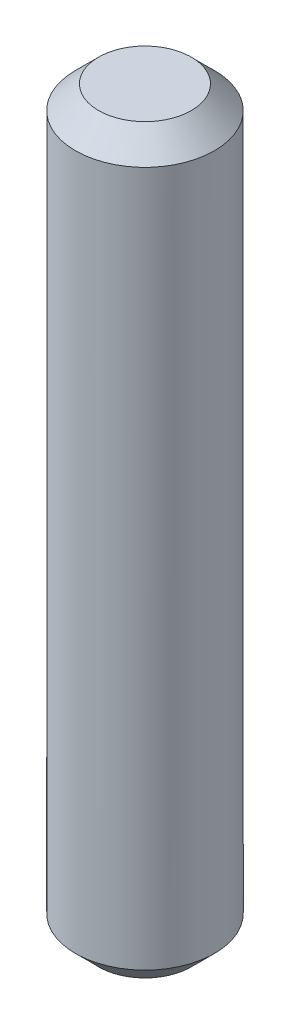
ISO-10303-21;
HEADER;
FILE_DESCRIPTION(('STEP AP214'),'2;1');
FILE_NAME('part.step','',(''),(''),'','','');
FILE_SCHEMA(('AUTOMOTIVE_DESIGN { 1 0 10303 214 1 1 1 1 }'));
ENDSEC;
DATA;
#1=APPLICATION_CONTEXT('core data for automotive mechanical design processes');
#2=APPLICATION_PROTOCOL_DEFINITION('international standard','automotive_design',2000,#1);
#3=PRODUCT_CONTEXT('',#1,'mechanical');
#4=PRODUCT('Part','Part','',(#3));
#5=PRODUCT_RELATED_PRODUCT_CATEGORY('part','',(#4));
#6=PRODUCT_DEFINITION_FORMATION('','',#4);
#7=PRODUCT_DEFINITION_CONTEXT('part definition',#1,'design');
#8=PRODUCT_DEFINITION('design','',#6,#7);
#9=PRODUCT_DEFINITION_SHAPE('','',#8);
#10=(LENGTH_UNIT() NAMED_UNIT(*) SI_UNIT(.MILLI.,.METRE.));
#11=(NAMED_UNIT(*) PLANE_ANGLE_UNIT() SI_UNIT($,.RADIAN.));
#12=(NAMED_UNIT(*) SI_UNIT($,.STERADIAN.) SOLID_ANGLE_UNIT());
#13=UNCERTAINTY_MEASURE_WITH_UNIT(LENGTH_MEASURE(1.E-05),#10,'distance_accuracy_value','');
#14=(GEOMETRIC_REPRESENTATION_CONTEXT(3) GLOBAL_UNCERTAINTY_ASSIGNED_CONTEXT((#13)) GLOBAL_UNIT_ASSIGNED_CONTEXT((#10,
#11,#12)) REPRESENTATION_CONTEXT('',''));
#15=CARTESIAN_POINT('',(0.,0.,0.));
#16=DIRECTION('',(0.,0.,1.));
#17=DIRECTION('',(1.,0.,0.));
#18=AXIS2_PLACEMENT_3D('',#15,#16,#17);
#19=CARTESIAN_POINT('',(0.,-4.,0.));
#20=DIRECTION('',(0.,1.,0.));
#21=DIRECTION('',(-1.,0.,0.));
#22=AXIS2_PLACEMENT_3D('',#19,#20,#21);
#23=PLANE('',#22);
#24=CARTESIAN_POINT('',(0.,-4.,0.));
#25=DIRECTION('',(0.,1.,0.));
#26=DIRECTION('',(-1.,0.,0.));
#27=AXIS2_PLACEMENT_3D('',#24,#25,#26);
#28=CIRCLE('',#27,0.500000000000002);
#29=CARTESIAN_POINT('',(-0.500000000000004,-4.,0.));
#30=VERTEX_POINT('',#29);
#31=EDGE_CURVE('E38',#30,#30,#28,.F.);
#32=ORIENTED_EDGE('',*,*,#31,.T.);
#33=EDGE_LOOP('',(#32));
#34=FACE_BOUND('',#33,.T.);
#35=ADVANCED_FACE('F32',(#34),#23,.F.);
#36=CARTESIAN_POINT('',(0.,14.1340291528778,0.));
#37=DIRECTION('',(0.,1.,0.));
#38=DIRECTION('',(-1.,0.,0.));
#39=AXIS2_PLACEMENT_3D('',#36,#37,#38);
#40=CYLINDRICAL_SURFACE('',#39,0.75);
#41=CARTESIAN_POINT('',(0.,-3.75,0.));
#42=DIRECTION('',(0.,1.,0.));
#43=DIRECTION('',(-1.,0.,0.));
#44=AXIS2_PLACEMENT_3D('',#41,#42,#43);
#45=CIRCLE('',#44,0.75);
#46=CARTESIAN_POINT('',(-0.750000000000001,-3.75,0.));
#47=VERTEX_POINT('',#46);
#48=EDGE_CURVE('E42',#47,#47,#45,.T.);
#49=ORIENTED_EDGE('',*,*,#48,.T.);
#50=EDGE_LOOP('',(#49));
#51=FACE_BOUND('',#50,.T.);
#52=CARTESIAN_POINT('',(0.,3.75,0.));
#53=DIRECTION('',(0.,-1.,0.));
#54=DIRECTION('',(1.,0.,0.));
#55=AXIS2_PLACEMENT_3D('',#52,#53,#54);
#56=CIRCLE('',#55,0.75);
#57=CARTESIAN_POINT('',(0.749999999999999,3.75,0.));
#58=VERTEX_POINT('',#57);
#59=EDGE_CURVE('E46',#58,#58,#56,.T.);
#60=ORIENTED_EDGE('',*,*,#59,.T.);
#61=EDGE_LOOP('',(#60));
#62=FACE_BOUND('',#61,.T.);
#63=ADVANCED_FACE('F52',(#51,#62),#40,.T.);
#64=CARTESIAN_POINT('',(0.,4.,0.));
#65=DIRECTION('',(0.,-1.,0.));
#66=DIRECTION('',(1.,0.,0.));
#67=AXIS2_PLACEMENT_3D('',#64,#65,#66);
#68=PLANE('',#67);
#69=CARTESIAN_POINT('',(0.,4.,0.));
#70=DIRECTION('',(0.,-1.,0.));
#71=DIRECTION('',(1.,0.,0.));
#72=AXIS2_PLACEMENT_3D('',#69,#70,#71);
#73=CIRCLE('',#72,0.499999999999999);
#74=CARTESIAN_POINT('',(0.499999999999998,4.,0.));
#75=VERTEX_POINT('',#74);
#76=EDGE_CURVE('E10',#75,#75,#73,.F.);
#77=ORIENTED_EDGE('',*,*,#76,.T.);
#78=EDGE_LOOP('',(#77));
#79=FACE_BOUND('',#78,.T.);
#80=ADVANCED_FACE('F62',(#79),#68,.F.);
#81=CARTESIAN_POINT('',(0.,-3.75,0.));
#82=DIRECTION('',(0.,1.,0.));
#83=DIRECTION('',(-1.,0.,0.));
#84=AXIS2_PLACEMENT_3D('',#81,#82,#83);
#85=CONICAL_SURFACE('',#84,0.75,0.785398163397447);
#86=ORIENTED_EDGE('',*,*,#31,.F.);
#87=EDGE_LOOP('',(#86));
#88=FACE_BOUND('',#87,.T.);
#89=ORIENTED_EDGE('',*,*,#48,.F.);
#90=EDGE_LOOP('',(#89));
#91=FACE_BOUND('',#90,.T.);
#92=ADVANCED_FACE('F57',(#88,#91),#85,.T.);
#93=CARTESIAN_POINT('',(0.,4.,0.));
#94=DIRECTION('',(0.,-1.,0.));
#95=DIRECTION('',(1.,0.,0.));
#96=AXIS2_PLACEMENT_3D('',#93,#94,#95);
#97=CONICAL_SURFACE('',#96,0.499999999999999,0.785398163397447);
#98=ORIENTED_EDGE('',*,*,#59,.F.);
#99=EDGE_LOOP('',(#98));
#100=FACE_BOUND('',#99,.T.);
#101=ORIENTED_EDGE('',*,*,#76,.F.);
#102=EDGE_LOOP('',(#101));
#103=FACE_BOUND('',#102,.T.);
#104=ADVANCED_FACE('F54',(#100,#103),#97,.T.);
#105=CLOSED_SHELL('',(#35,#63,#80,#92,#104));
#106=MANIFOLD_SOLID_BREP('B2',#105);
#107=ADVANCED_BREP_SHAPE_REPRESENTATION('',(#18,#106),#14);
#108=SHAPE_DEFINITION_REPRESENTATION(#9,#107);
ENDSEC;
END-ISO-10303-21;
